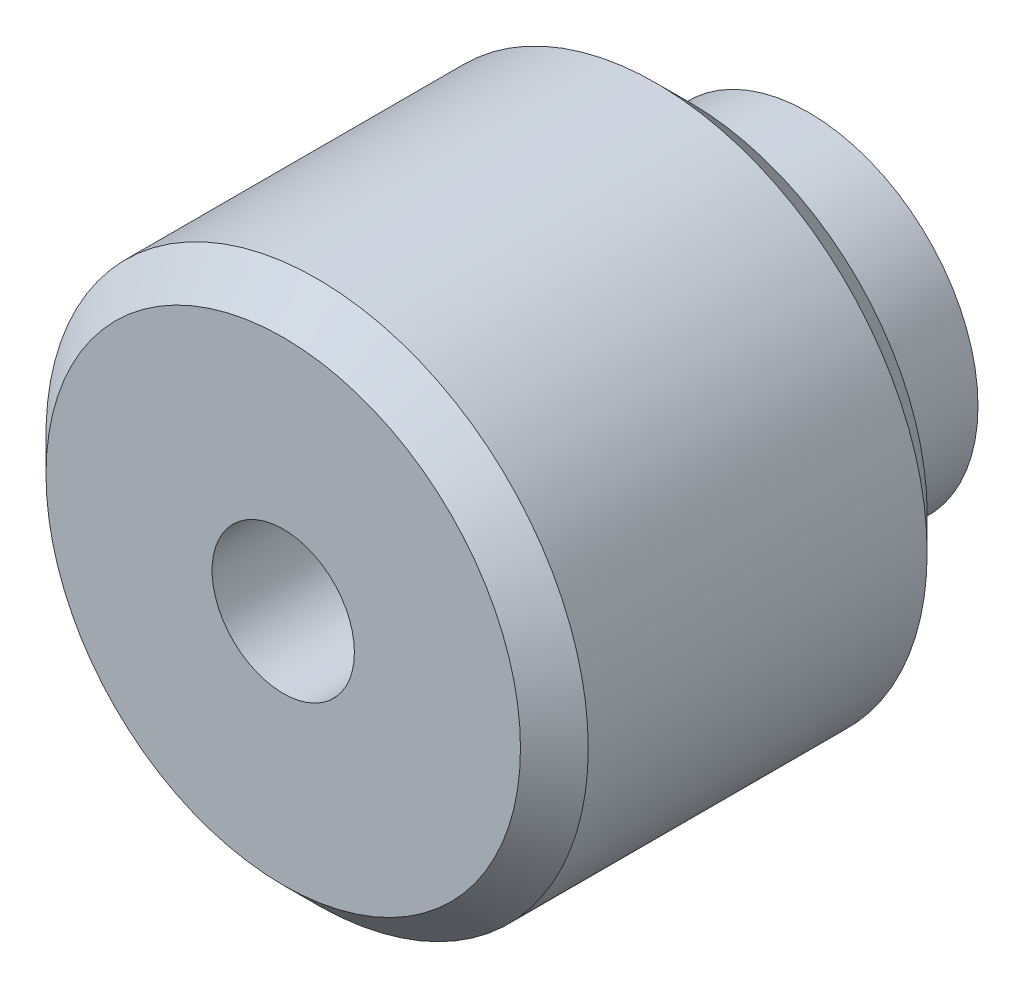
from build123d import *

# Parameters (mm, degrees)
SKETCH1_R         = 8
EXTRUDE1_DEPTH    = 12
SKETCH2_R         = 5
EXTRUDE2_DEPTH    = 3.5
CHAMFER1_SIZE     = 1
M5_TAPPED_HOLE1_D = 4.2


with BuildPart() as part:
    # Sketch1 → Extrude1 (new body)
    with BuildSketch(Plane.XY):
        Circle(SKETCH1_R)
    extrude(amount=EXTRUDE1_DEPTH)

    # Sketch2 → Extrude2 (add)
    with BuildSketch(Plane(origin=(0, 0, 0), x_dir=(-1, 0, 0), z_dir=(0, 0, -1))):
        with Locations(Location((0, 0, 0), (0, 0, 180))):
            Circle(SKETCH2_R)
    extrude(amount=EXTRUDE2_DEPTH)

    # Chamfer1
    chamfer1_edges = [part.edges().sort_by_distance(p)[0] for p in [
        (-8, 0, 0),
        (-8, 0, 12),
    ]]
    chamfer(chamfer1_edges, length=CHAMFER1_SIZE)

    # M5 Tapped Hole1 (through all)
    with Locations(Plane.XY.offset(12)):
        with Locations((0, 0)):
            Hole(M5_TAPPED_HOLE1_D / 2)


solid = part.part
